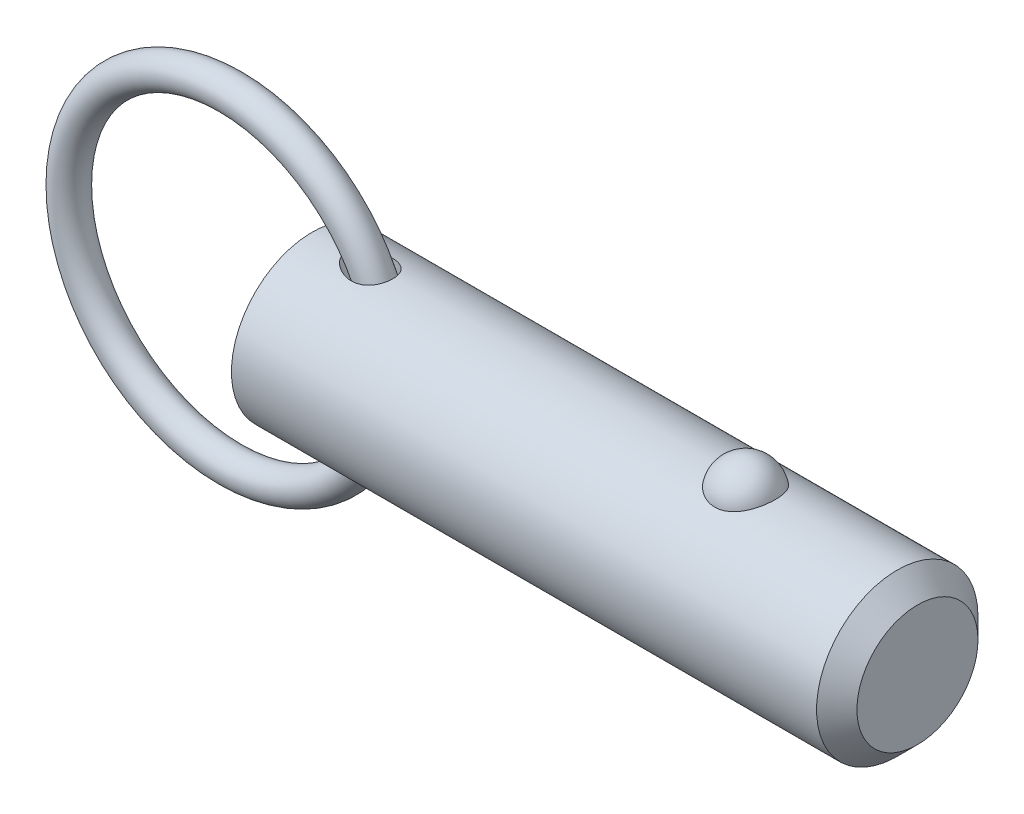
ISO-10303-21;
HEADER;
FILE_DESCRIPTION(('STEP AP214'),'2;1');
FILE_NAME('part.step','',(''),(''),'','','');
FILE_SCHEMA(('AUTOMOTIVE_DESIGN { 1 0 10303 214 1 1 1 1 }'));
ENDSEC;
DATA;
#1=APPLICATION_CONTEXT('core data for automotive mechanical design processes');
#2=APPLICATION_PROTOCOL_DEFINITION('international standard','automotive_design',2000,#1);
#3=PRODUCT_CONTEXT('',#1,'mechanical');
#4=PRODUCT('Part','Part','',(#3));
#5=PRODUCT_RELATED_PRODUCT_CATEGORY('part','',(#4));
#6=PRODUCT_DEFINITION_FORMATION('','',#4);
#7=PRODUCT_DEFINITION_CONTEXT('part definition',#1,'design');
#8=PRODUCT_DEFINITION('design','',#6,#7);
#9=PRODUCT_DEFINITION_SHAPE('','',#8);
#10=(LENGTH_UNIT() NAMED_UNIT(*) SI_UNIT(.MILLI.,.METRE.));
#11=(NAMED_UNIT(*) PLANE_ANGLE_UNIT() SI_UNIT($,.RADIAN.));
#12=(NAMED_UNIT(*) SI_UNIT($,.STERADIAN.) SOLID_ANGLE_UNIT());
#13=UNCERTAINTY_MEASURE_WITH_UNIT(LENGTH_MEASURE(1.E-05),#10,'distance_accuracy_value','');
#14=(GEOMETRIC_REPRESENTATION_CONTEXT(3) GLOBAL_UNCERTAINTY_ASSIGNED_CONTEXT((#13)) GLOBAL_UNIT_ASSIGNED_CONTEXT((#10,
#11,#12)) REPRESENTATION_CONTEXT('',''));
#15=CARTESIAN_POINT('',(0.,0.,0.));
#16=DIRECTION('',(0.,0.,1.));
#17=DIRECTION('',(1.,0.,0.));
#18=AXIS2_PLACEMENT_3D('',#15,#16,#17);
#19=CARTESIAN_POINT('',(-9.66825126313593,0.,0.));
#20=DIRECTION('',(0.,0.,1.));
#21=DIRECTION('',(1.,0.,0.));
#22=AXIS2_PLACEMENT_3D('',#19,#20,#21);
#23=TOROIDAL_SURFACE('',#22,19.05,1.905);
#24=CARTESIAN_POINT('',(11.2867487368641,0.,0.));
#25=VERTEX_POINT('',#24);
#26=VERTEX_LOOP('',#25);
#27=FACE_BOUND('',#26,.T.);
#28=ADVANCED_FACE('P0_F12',(#27),#23,.T.);
#29=CLOSED_SHELL('',(#28));
#30=MANIFOLD_SOLID_BREP('P0_B1',#29);
#31=CARTESIAN_POINT('',(0.,0.,0.));
#32=DIRECTION('',(1.,0.,0.));
#33=DIRECTION('',(0.,0.,-1.));
#34=AXIS2_PLACEMENT_3D('',#31,#32,#33);
#35=CYLINDRICAL_SURFACE('',#34,9.525);
#36=CARTESIAN_POINT('',(4.56693409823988,9.43141941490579,-1.33189820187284));
#37=CARTESIAN_POINT('',(4.70260475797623,9.41020313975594,-1.48215931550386));
#38=CARTESIAN_POINT('',(4.85555680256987,9.38755003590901,-1.61683982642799));
#39=CARTESIAN_POINT('',(5.10171959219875,9.35450554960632,-1.79512943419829));
#40=CARTESIAN_POINT('',(5.18674514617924,9.34362629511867,-1.85068909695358));
#41=CARTESIAN_POINT('',(5.36154389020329,9.32258514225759,-1.95392002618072));
#42=CARTESIAN_POINT('',(5.45131542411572,9.31242299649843,-2.00159402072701));
#43=CARTESIAN_POINT('',(5.70070211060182,9.28632120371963,-2.12033289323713));
#44=CARTESIAN_POINT('',(5.86420408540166,9.27146938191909,-2.18362944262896));
#45=CARTESIAN_POINT('',(6.19893345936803,9.24694163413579,-2.28525783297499));
#46=CARTESIAN_POINT('',(6.37015384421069,9.23726110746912,-2.32361187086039));
#47=CARTESIAN_POINT('',(6.73531776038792,9.22400982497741,-2.37575048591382));
#48=CARTESIAN_POINT('',(6.92975826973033,9.22118808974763,-2.38652934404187));
#49=CARTESIAN_POINT('',(7.21995443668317,9.22416297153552,-2.37494980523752));
#50=CARTESIAN_POINT('',(7.31643847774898,9.22635560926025,-2.366466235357));
#51=CARTESIAN_POINT('',(7.50796421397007,9.2331428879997,-2.33985028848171));
#52=CARTESIAN_POINT('',(7.60300650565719,9.23773650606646,-2.32172202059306));
#53=CARTESIAN_POINT('',(7.83273114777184,9.25183311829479,-2.26504721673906));
#54=CARTESIAN_POINT('',(7.96603028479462,9.26261470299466,-2.2209856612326));
#55=CARTESIAN_POINT('',(8.22310899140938,9.28816519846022,-2.11157306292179));
#56=CARTESIAN_POINT('',(8.34689477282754,9.30293147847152,-2.04623606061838));
#57=CARTESIAN_POINT('',(8.58136049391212,9.3349416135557,-1.89485344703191));
#58=CARTESIAN_POINT('',(8.69199721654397,9.35219324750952,-1.80874222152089));
#59=CARTESIAN_POINT('',(8.89592093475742,9.38707016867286,-1.61799188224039));
#60=CARTESIAN_POINT('',(8.98920771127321,9.40469546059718,-1.51335253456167));
#61=CARTESIAN_POINT('',(9.15057731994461,9.43713590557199,-1.29519427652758));
#62=CARTESIAN_POINT('',(9.21980158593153,9.45205440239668,-1.18253282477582));
#63=CARTESIAN_POINT('',(9.33826736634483,9.47856708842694,-0.946802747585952));
#64=CARTESIAN_POINT('',(9.38751161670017,9.49016173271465,-0.823735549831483));
#65=CARTESIAN_POINT('',(9.46423850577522,9.50859378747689,-0.572614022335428));
#66=CARTESIAN_POINT('',(9.49202393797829,9.5154972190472,-0.444656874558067));
#67=CARTESIAN_POINT('',(9.52636926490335,9.52406905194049,-0.185752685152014));
#68=CARTESIAN_POINT('',(9.53292923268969,9.52573747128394,-0.0548056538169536));
#69=CARTESIAN_POINT('',(9.52467276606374,9.52365852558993,0.206503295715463));
#70=CARTESIAN_POINT('',(9.50983454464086,9.51990564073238,0.336864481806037));
#71=CARTESIAN_POINT('',(9.45907362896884,9.50737852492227,0.59316631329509));
#72=CARTESIAN_POINT('',(9.42315106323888,9.49860432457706,0.71910698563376));
#73=CARTESIAN_POINT('',(9.33106648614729,9.47698928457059,0.96295935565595));
#74=CARTESIAN_POINT('',(9.27490839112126,9.46414923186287,1.08087260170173));
#75=CARTESIAN_POINT('',(9.14375803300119,9.43581000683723,1.30534632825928));
#76=CARTESIAN_POINT('',(9.06876720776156,9.42031103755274,1.41190767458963));
#77=CARTESIAN_POINT('',(8.90203187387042,9.38836719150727,1.61069439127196));
#78=CARTESIAN_POINT('',(8.81029913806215,9.37192298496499,1.70292975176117));
#79=CARTESIAN_POINT('',(8.61268775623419,9.33985045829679,1.87086859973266));
#80=CARTESIAN_POINT('',(8.50680947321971,9.3242221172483,1.94657251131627));
#81=CARTESIAN_POINT('',(8.28220546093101,9.29513431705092,2.08109032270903));
#82=CARTESIAN_POINT('',(8.16329919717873,9.28171415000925,2.1396103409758));
#83=CARTESIAN_POINT('',(7.91756052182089,9.25859072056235,2.23755716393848));
#84=CARTESIAN_POINT('',(7.79072606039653,9.24888842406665,2.27697900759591));
#85=CARTESIAN_POINT('',(7.52377913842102,9.23338749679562,2.33907806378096));
#86=CARTESIAN_POINT('',(7.38334767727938,9.22789571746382,2.36044900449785));
#87=CARTESIAN_POINT('',(7.10081394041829,9.22210229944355,2.3829751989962));
#88=CARTESIAN_POINT('',(6.95871103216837,9.22180269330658,2.38412253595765));
#89=CARTESIAN_POINT('',(6.65642691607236,9.22632724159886,2.36656230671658));
#90=CARTESIAN_POINT('',(6.49641694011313,9.23185415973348,2.3451317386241));
#91=CARTESIAN_POINT('',(6.18115433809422,9.24811737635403,2.28014143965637));
#92=CARTESIAN_POINT('',(6.02590710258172,9.25885936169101,2.23655754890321));
#93=CARTESIAN_POINT('',(5.6990472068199,9.28624254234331,2.12025087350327));
#94=CARTESIAN_POINT('',(5.52873601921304,9.30354853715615,2.04400672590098));
#95=CARTESIAN_POINT('',(5.20289495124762,9.34106989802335,1.86504730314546));
#96=CARTESIAN_POINT('',(5.04735968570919,9.36128419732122,1.76234172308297));
#97=CARTESIAN_POINT('',(4.79287124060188,9.39697639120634,1.55895334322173));
#98=CARTESIAN_POINT('',(4.68938704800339,9.41240250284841,1.46392900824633));
#99=CARTESIAN_POINT('',(4.49847141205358,9.44202586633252,1.25875918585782));
#100=CARTESIAN_POINT('',(4.41101129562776,9.45622528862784,1.1486413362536));
#101=CARTESIAN_POINT('',(4.27502257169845,9.47888210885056,0.940600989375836));
#102=CARTESIAN_POINT('',(4.22216329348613,9.48791121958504,0.845586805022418));
#103=CARTESIAN_POINT('',(4.13241478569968,9.50344321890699,0.648051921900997));
#104=CARTESIAN_POINT('',(4.09551182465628,9.50994827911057,0.545537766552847));
#105=CARTESIAN_POINT('',(4.04043124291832,9.51971586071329,0.334452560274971));
#106=CARTESIAN_POINT('',(4.02240728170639,9.52295176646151,0.225839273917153));
#107=CARTESIAN_POINT('',(4.00750873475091,9.52562364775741,0.00713006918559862));
#108=CARTESIAN_POINT('',(4.01062334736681,9.52506156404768,-0.10296506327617));
#109=CARTESIAN_POINT('',(4.03592967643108,9.52053221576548,-0.306944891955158));
#110=CARTESIAN_POINT('',(4.05571676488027,9.51699426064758,-0.401151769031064));
#111=CARTESIAN_POINT('',(4.10967975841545,9.5074546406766,-0.585176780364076));
#112=CARTESIAN_POINT('',(4.14385995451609,9.50145224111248,-0.674993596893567));
#113=CARTESIAN_POINT('',(4.23261356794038,9.48611703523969,-0.866116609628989));
#114=CARTESIAN_POINT('',(4.28990016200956,9.47635800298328,-0.96612166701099));
#115=CARTESIAN_POINT('',(4.41856577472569,9.45502867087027,-1.15640011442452));
#116=CARTESIAN_POINT('',(4.48996918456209,9.44345524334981,-1.24665623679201));
#117=CARTESIAN_POINT('',(4.56693409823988,9.43141941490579,-1.33189820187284));
#118=B_SPLINE_CURVE_WITH_KNOTS('',3,(#36,#37,#38,#39,#40,#41,#42,#43,#44,#45,#46,#47,#48,#49,
#50,#51,#52,#53,#54,#55,#56,#57,#58,#59,#60,#61,#62,#63,#64,#65,#66,#67,#68,#69,#70,#71,#72,#73,
#74,#75,#76,#77,#78,#79,#80,#81,#82,#83,#84,#85,#86,#87,#88,#89,#90,#91,#92,#93,#94,#95,#96,#97,
#98,#99,#100,#101,#102,#103,#104,#105,#106,#107,#108,#109,#110,#111,#112,#113,#114,#115,#116,
#117),.UNSPECIFIED.,.T.,.F.,(4,2,2,2,2,2,2,2,2,2,2,2,2,2,2,2,2,2,2,2,2,2,2,2,2,2,2,2,2,2,2,2,2,
2,2,2,2,2,2,2,4),(0.,0.609951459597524,0.916123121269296,1.22218863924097,1.74791337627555,
2.27316961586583,2.85362722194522,3.14383229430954,3.43391382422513,3.85437497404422,
4.27455920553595,4.69608835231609,5.11762282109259,5.5149005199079,5.91212379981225,
6.30363414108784,6.69514313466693,7.08705103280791,7.47895654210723,7.87078624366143,
8.26258603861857,8.65411137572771,9.04562666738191,9.44349251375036,9.84146165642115,
10.2662286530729,10.6911619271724,11.1739180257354,11.6572017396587,12.2170157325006,
12.776624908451,13.1992556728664,13.6211226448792,13.9471990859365,14.2729943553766,
14.6014211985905,14.9296802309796,15.2173810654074,15.505167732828,15.8505863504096,
16.1966070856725),.UNSPECIFIED.);
#119=CARTESIAN_POINT('',(4.56693409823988,9.43141941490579,-1.33189820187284));
#120=VERTEX_POINT('',#119);
#121=EDGE_CURVE('P1_E40',#120,#120,#118,.T.);
#122=ORIENTED_EDGE('',*,*,#121,.T.);
#123=EDGE_LOOP('',(#122));
#124=FACE_BOUND('',#123,.T.);
#125=CARTESIAN_POINT('',(69.04875,0.,0.));
#126=DIRECTION('',(1.,0.,0.));
#127=DIRECTION('',(0.,0.,-1.));
#128=AXIS2_PLACEMENT_3D('',#125,#126,#127);
#129=CIRCLE('',#128,9.525);
#130=CARTESIAN_POINT('',(69.04875,0.,-9.525));
#131=VERTEX_POINT('',#130);
#132=EDGE_CURVE('P1_E25',#131,#131,#129,.T.);
#133=ORIENTED_EDGE('',*,*,#132,.F.);
#134=EDGE_LOOP('',(#133));
#135=FACE_BOUND('',#134,.T.);
#136=CARTESIAN_POINT('',(0.,0.,0.));
#137=DIRECTION('',(1.,0.,0.));
#138=DIRECTION('',(0.,0.,-1.));
#139=AXIS2_PLACEMENT_3D('',#136,#137,#138);
#140=CIRCLE('',#139,9.525);
#141=CARTESIAN_POINT('',(0.,0.,-9.525));
#142=VERTEX_POINT('',#141);
#143=EDGE_CURVE('P1_E9',#142,#142,#140,.T.);
#144=ORIENTED_EDGE('',*,*,#143,.T.);
#145=EDGE_LOOP('',(#144));
#146=FACE_BOUND('',#145,.T.);
#147=CARTESIAN_POINT('',(51.1457573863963,8.80405803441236,3.63513233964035));
#148=CARTESIAN_POINT('',(51.0516766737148,8.80405953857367,3.63513053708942));
#149=CARTESIAN_POINT('',(50.9575618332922,8.80561325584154,3.6313746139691));
#150=CARTESIAN_POINT('',(50.7700126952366,8.81177748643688,3.61638665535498));
#151=CARTESIAN_POINT('',(50.6765788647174,8.81638992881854,3.60514990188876));
#152=CARTESIAN_POINT('',(50.3979452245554,8.8346711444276,3.56024627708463));
#153=CARTESIAN_POINT('',(50.2146916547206,8.85278327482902,3.51538626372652));
#154=CARTESIAN_POINT('',(49.859509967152,8.89871214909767,3.39742145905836));
#155=CARTESIAN_POINT('',(49.6875533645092,8.9265032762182,3.32439116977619));
#156=CARTESIAN_POINT('',(49.358707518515,8.98874819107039,3.1522024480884));
#157=CARTESIAN_POINT('',(49.2018114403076,9.02319893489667,3.05305594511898));
#158=CARTESIAN_POINT('',(48.9022147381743,9.09629186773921,2.82797815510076));
#159=CARTESIAN_POINT('',(48.7600600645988,9.13502685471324,2.7013513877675));
#160=CARTESIAN_POINT('',(48.4982999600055,9.2118657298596,2.4264193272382));
#161=CARTESIAN_POINT('',(48.3787015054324,9.2499694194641,2.27810735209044));
#162=CARTESIAN_POINT('',(48.159645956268,9.32341082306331,1.95652290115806));
#163=CARTESIAN_POINT('',(48.0613174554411,9.35855090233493,1.78243511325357));
#164=CARTESIAN_POINT('',(47.8938190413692,9.42045142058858,1.41937246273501));
#165=CARTESIAN_POINT('',(47.8246511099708,9.44721128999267,1.23039658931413));
#166=CARTESIAN_POINT('',(47.7161994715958,9.48990641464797,0.840370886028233));
#167=CARTESIAN_POINT('',(47.6772880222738,9.50570658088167,0.639202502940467));
#168=CARTESIAN_POINT('',(47.6315550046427,9.52433146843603,0.232664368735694));
#169=CARTESIAN_POINT('',(47.6247324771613,9.52715657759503,0.0272947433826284));
#170=CARTESIAN_POINT('',(47.643255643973,9.51956918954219,-0.380478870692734));
#171=CARTESIAN_POINT('',(47.6684052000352,9.50923740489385,-0.582893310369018));
#172=CARTESIAN_POINT('',(47.75002537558,9.47651897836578,-0.980293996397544));
#173=CARTESIAN_POINT('',(47.8064966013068,9.45413210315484,-1.17528009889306));
#174=CARTESIAN_POINT('',(47.9497192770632,9.39954044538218,-1.55263697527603));
#175=CARTESIAN_POINT('',(48.0365124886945,9.36732213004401,-1.73498993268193));
#176=CARTESIAN_POINT('',(48.2386103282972,9.29640700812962,-2.08177763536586));
#177=CARTESIAN_POINT('',(48.3539172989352,9.25770966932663,-2.24621090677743));
#178=CARTESIAN_POINT('',(48.611264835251,9.17775604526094,-2.5533833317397));
#179=CARTESIAN_POINT('',(48.7534344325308,9.136488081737,-2.69601150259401));
#180=CARTESIAN_POINT('',(49.06089985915,9.05620497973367,-2.95451229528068));
#181=CARTESIAN_POINT('',(49.226193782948,9.01718965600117,-3.07038711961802));
#182=CARTESIAN_POINT('',(49.572052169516,8.9468001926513,-3.26976836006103));
#183=CARTESIAN_POINT('',(49.7522278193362,8.91528408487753,-3.35389750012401));
#184=CARTESIAN_POINT('',(50.1256514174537,8.86272514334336,-3.49043503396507));
#185=CARTESIAN_POINT('',(50.3188944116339,8.8416783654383,-3.54285537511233));
#186=CARTESIAN_POINT('',(50.7025036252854,8.81348056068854,-3.61241306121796));
#187=CARTESIAN_POINT('',(50.8925251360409,8.80568348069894,-3.63119339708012));
#188=CARTESIAN_POINT('',(51.2731906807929,8.80289410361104,-3.63795342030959));
#189=CARTESIAN_POINT('',(51.4638345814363,8.80789922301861,-3.62593932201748));
#190=CARTESIAN_POINT('',(51.834007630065,8.8297491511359,-3.57238430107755));
#191=CARTESIAN_POINT('',(52.0136976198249,8.84621463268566,-3.53178890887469));
#192=CARTESIAN_POINT('',(52.3634226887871,8.88875330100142,-3.42331083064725));
#193=CARTESIAN_POINT('',(52.5334569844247,8.91482726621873,-3.35542593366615));
#194=CARTESIAN_POINT('',(52.8632377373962,8.97448239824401,-3.19248225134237));
#195=CARTESIAN_POINT('',(53.0226801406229,9.00821446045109,-3.09686474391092));
#196=CARTESIAN_POINT('',(53.3235136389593,9.07935398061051,-2.88162736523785));
#197=CARTESIAN_POINT('',(53.4649005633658,9.11676228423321,-2.76200196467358));
#198=CARTESIAN_POINT('',(53.7333193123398,9.19347419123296,-2.49516285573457));
#199=CARTESIAN_POINT('',(53.8592750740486,9.23277872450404,-2.34686614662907));
#200=CARTESIAN_POINT('',(54.0855227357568,9.30737610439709,-2.03093683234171));
#201=CARTESIAN_POINT('',(54.1858100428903,9.34266823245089,-1.86330077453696));
#202=CARTESIAN_POINT('',(54.3615149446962,9.40674710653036,-1.50744893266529));
#203=CARTESIAN_POINT('',(54.436041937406,9.4352917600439,-1.31874876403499));
#204=CARTESIAN_POINT('',(54.5541650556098,9.48144132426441,-0.930631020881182));
#205=CARTESIAN_POINT('',(54.5977608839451,9.49904612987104,-0.731213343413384));
#206=CARTESIAN_POINT('',(54.6531580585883,9.5215314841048,-0.327147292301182));
#207=CARTESIAN_POINT('',(54.6649354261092,9.52640243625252,-0.12249509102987));
#208=CARTESIAN_POINT('',(54.6563825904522,9.52289571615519,0.286018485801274));
#209=CARTESIAN_POINT('',(54.6360530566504,9.51451832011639,0.489879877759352));
#210=CARTESIAN_POINT('',(54.5638840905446,9.48544083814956,0.889994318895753));
#211=CARTESIAN_POINT('',(54.5121993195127,9.46480124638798,1.08627971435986));
#212=CARTESIAN_POINT('',(54.3784917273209,9.4133389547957,1.46682086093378));
#213=CARTESIAN_POINT('',(54.2964668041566,9.38251554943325,1.65107577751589));
#214=CARTESIAN_POINT('',(54.1031929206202,9.31365636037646,2.00346348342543));
#215=CARTESIAN_POINT('',(53.9917838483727,9.27558138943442,2.17150083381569));
#216=CARTESIAN_POINT('',(53.7422947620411,9.19638714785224,2.4856311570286));
#217=CARTESIAN_POINT('',(53.6042163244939,9.15526805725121,2.63172542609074));
#218=CARTESIAN_POINT('',(53.3048438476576,9.07465393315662,2.89750997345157));
#219=CARTESIAN_POINT('',(53.1436109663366,9.03515496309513,3.01726776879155));
#220=CARTESIAN_POINT('',(52.8016136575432,8.96227564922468,3.22732920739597));
#221=CARTESIAN_POINT('',(52.620841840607,8.92889763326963,3.31762165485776));
#222=CARTESIAN_POINT('',(52.2514451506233,8.8734538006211,3.46314419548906));
#223=CARTESIAN_POINT('',(52.0633237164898,8.85102983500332,3.51950082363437));
#224=CARTESIAN_POINT('',(51.7757869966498,8.8266696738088,3.57993683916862));
#225=CARTESIAN_POINT('',(51.6791339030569,8.82009725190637,3.59606217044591));
#226=CARTESIAN_POINT('',(51.4846770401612,8.81020897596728,3.62022512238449));
#227=CARTESIAN_POINT('',(51.3868741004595,8.80689090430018,3.62826825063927));
#228=CARTESIAN_POINT('',(51.2412243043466,8.80445615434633,3.63416760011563));
#229=CARTESIAN_POINT('',(51.1934952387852,8.80405727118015,3.63513325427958));
#230=CARTESIAN_POINT('',(51.1457573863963,8.80405803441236,3.63513233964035));
#231=B_SPLINE_CURVE_WITH_KNOTS('',3,(#147,#148,#149,#150,#151,#152,#153,#154,#155,#156,#157,
#158,#159,#160,#161,#162,#163,#164,#165,#166,#167,#168,#169,#170,#171,#172,#173,#174,#175,#176,
#177,#178,#179,#180,#181,#182,#183,#184,#185,#186,#187,#188,#189,#190,#191,#192,#193,#194,#195,
#196,#197,#198,#199,#200,#201,#202,#203,#204,#205,#206,#207,#208,#209,#210,#211,#212,#213,#214,
#215,#216,#217,#218,#219,#220,#221,#222,#223,#224,#225,#226,#227,#228,#229,#230),.UNSPECIFIED.,
.T.,.F.,(4,2,2,2,2,2,2,2,2,2,2,2,2,2,2,2,2,2,2,2,2,2,2,2,2,2,2,2,2,2,2,2,2,2,2,2,2,2,2,2,2,4),
(0.,0.282202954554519,0.564584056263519,1.13017050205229,1.69427128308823,2.25811483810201,
2.83836627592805,3.41879688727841,4.02497117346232,4.63118665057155,5.24474754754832,
5.85829010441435,6.46808687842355,7.0778954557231,7.68854723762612,8.29924920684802,
8.91296283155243,9.52662591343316,10.1275338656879,10.7282152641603,11.2986646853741,
11.868998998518,12.4213015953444,12.973648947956,13.5380053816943,14.1024919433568,
14.695298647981,15.2882113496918,15.8999469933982,16.5116885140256,17.1238909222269,
17.7360805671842,18.3452748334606,18.9545113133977,19.567138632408,20.1797297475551,
20.7907316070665,21.4019653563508,21.9915938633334,22.2859053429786,22.580016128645,
22.723209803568),.UNSPECIFIED.);
#232=CARTESIAN_POINT('',(51.1457573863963,8.80405803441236,3.63513233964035));
#233=VERTEX_POINT('',#232);
#234=EDGE_CURVE('P1_E34',#233,#233,#231,.T.);
#235=ORIENTED_EDGE('',*,*,#234,.T.);
#236=EDGE_LOOP('',(#235));
#237=FACE_BOUND('',#236,.T.);
#238=CARTESIAN_POINT('',(4.56693409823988,-9.43141941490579,-1.33189820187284));
#239=CARTESIAN_POINT('',(4.48932984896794,-9.4435553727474,-1.24594548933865));
#240=CARTESIAN_POINT('',(4.41737309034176,-9.45522193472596,-1.1548795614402));
#241=CARTESIAN_POINT('',(4.2878104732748,-9.47670896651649,-0.962782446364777));
#242=CARTESIAN_POINT('',(4.23019403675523,-9.48653079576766,-0.861758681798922));
#243=CARTESIAN_POINT('',(4.13254559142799,-9.5034118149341,-0.649723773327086));
#244=CARTESIAN_POINT('',(4.09271158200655,-9.51043980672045,-0.538615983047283));
#245=CARTESIAN_POINT('',(4.04973167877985,-9.51806966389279,-0.367764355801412));
#246=CARTESIAN_POINT('',(4.03820037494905,-9.52012756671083,-0.310118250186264));
#247=CARTESIAN_POINT('',(4.02100287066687,-9.52320274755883,-0.193935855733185));
#248=CARTESIAN_POINT('',(4.01533565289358,-9.52422020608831,-0.13539972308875));
#249=CARTESIAN_POINT('',(4.00817074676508,-9.52550497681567,0.0247266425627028));
#250=CARTESIAN_POINT('',(4.01270492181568,-9.52468821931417,0.126661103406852));
#251=CARTESIAN_POINT('',(4.0395497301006,-9.51988506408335,0.328012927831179));
#252=CARTESIAN_POINT('',(4.0618645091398,-9.51589792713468,0.427429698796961));
#253=CARTESIAN_POINT('',(4.12088980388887,-9.5054852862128,0.61636200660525));
#254=CARTESIAN_POINT('',(4.15684838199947,-9.49918763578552,0.706123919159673));
#255=CARTESIAN_POINT('',(4.24094647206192,-9.48470618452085,0.879522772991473));
#256=CARTESIAN_POINT('',(4.28909090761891,-9.47652162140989,0.96315722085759));
#257=CARTESIAN_POINT('',(4.42295891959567,-9.45426317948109,1.16513741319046));
#258=CARTESIAN_POINT('',(4.51523752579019,-9.43933320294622,1.27905352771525));
#259=CARTESIAN_POINT('',(4.71682295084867,-9.40825940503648,1.49055892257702));
#260=CARTESIAN_POINT('',(4.8261728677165,-9.39211256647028,1.58810554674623));
#261=CARTESIAN_POINT('',(5.09064226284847,-9.35555264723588,1.79246125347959));
#262=CARTESIAN_POINT('',(5.24990411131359,-9.33524115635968,1.89393122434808));
#263=CARTESIAN_POINT('',(5.58309255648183,-9.29785396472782,2.06968659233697));
#264=CARTESIAN_POINT('',(5.75702897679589,-9.28078045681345,2.14395359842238));
#265=CARTESIAN_POINT('',(6.11646882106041,-9.25213303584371,2.26440412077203));
#266=CARTESIAN_POINT('',(6.3020558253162,-9.2406056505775,2.31035092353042));
#267=CARTESIAN_POINT('',(6.67856093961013,-9.22541807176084,2.37029728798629));
#268=CARTESIAN_POINT('',(6.86947045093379,-9.2217458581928,2.3843456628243));
#269=CARTESIAN_POINT('',(7.21217144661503,-9.22344239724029,2.37775005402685));
#270=CARTESIAN_POINT('',(7.36409439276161,-9.22713860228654,2.36352577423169));
#271=CARTESIAN_POINT('',(7.66346227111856,-9.24048072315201,2.31082299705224));
#272=CARTESIAN_POINT('',(7.81090958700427,-9.25012341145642,2.27235765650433));
#273=CARTESIAN_POINT('',(8.09730316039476,-9.2746609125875,2.17003648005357));
#274=CARTESIAN_POINT('',(8.23619652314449,-9.28958517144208,2.10603803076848));
#275=CARTESIAN_POINT('',(8.49918675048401,-9.32290326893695,1.9532444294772));
#276=CARTESIAN_POINT('',(8.62328895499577,-9.34129584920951,1.86445826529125));
#277=CARTESIAN_POINT('',(8.84006515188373,-9.37706953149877,1.67466761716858));
#278=CARTESIAN_POINT('',(8.93465172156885,-9.39436331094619,1.57582357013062));
#279=CARTESIAN_POINT('',(9.1049023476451,-9.42761680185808,1.362809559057));
#280=CARTESIAN_POINT('',(9.18057146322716,-9.44357686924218,1.24864370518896));
#281=CARTESIAN_POINT('',(9.30789178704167,-9.47159985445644,1.01379272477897));
#282=CARTESIAN_POINT('',(9.3604554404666,-9.48380365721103,0.893617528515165));
#283=CARTESIAN_POINT('',(9.44498362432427,-9.50388751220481,0.645890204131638));
#284=CARTESIAN_POINT('',(9.47694947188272,-9.51176784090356,0.518338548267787));
#285=CARTESIAN_POINT('',(9.51944262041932,-9.52232073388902,0.260103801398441));
#286=CARTESIAN_POINT('',(9.53006646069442,-9.52501674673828,0.129437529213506));
#287=CARTESIAN_POINT('',(9.52993291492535,-9.52498309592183,-0.131885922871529));
#288=CARTESIAN_POINT('',(9.51917525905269,-9.52225336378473,-0.262543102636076));
#289=CARTESIAN_POINT('',(9.47648788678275,-9.51165418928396,-0.520312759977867));
#290=CARTESIAN_POINT('',(9.44453086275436,-9.50377811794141,-0.647420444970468));
#291=CARTESIAN_POINT('',(9.36015568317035,-9.48373425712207,-0.894290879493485));
#292=CARTESIAN_POINT('',(9.30773827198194,-9.47156662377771,-1.01405389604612));
#293=CARTESIAN_POINT('',(9.18380895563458,-9.44428888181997,-1.24269386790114));
#294=CARTESIAN_POINT('',(9.11232064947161,-9.42918241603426,-1.3515840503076));
#295=CARTESIAN_POINT('',(8.95212687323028,-9.39767706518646,-1.55562459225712));
#296=CARTESIAN_POINT('',(8.86342281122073,-9.3812782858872,-1.65077607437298));
#297=CARTESIAN_POINT('',(8.67104443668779,-9.34891827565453,-1.82517515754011));
#298=CARTESIAN_POINT('',(8.56732858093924,-9.33295841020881,-1.90437711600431));
#299=CARTESIAN_POINT('',(8.34818438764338,-9.30317889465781,-2.0449122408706));
#300=CARTESIAN_POINT('',(8.23275529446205,-9.2893593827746,-2.10624425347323));
#301=CARTESIAN_POINT('',(7.98961240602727,-9.26475003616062,-2.2120340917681));
#302=CARTESIAN_POINT('',(7.86162088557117,-9.25407358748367,-2.25587700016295));
#303=CARTESIAN_POINT('',(7.60027499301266,-9.23720810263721,-2.32397032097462));
#304=CARTESIAN_POINT('',(7.46691858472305,-9.23102078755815,-2.34821321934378));
#305=CARTESIAN_POINT('',(7.18516230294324,-9.22302718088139,-2.37943079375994));
#306=CARTESIAN_POINT('',(7.0365445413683,-9.22169704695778,-2.38452997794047));
#307=CARTESIAN_POINT('',(6.74015049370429,-9.22442327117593,-2.37395141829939));
#308=CARTESIAN_POINT('',(6.59237455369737,-9.22848170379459,-2.35826567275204));
#309=CARTESIAN_POINT('',(6.27762777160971,-9.2422287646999,-2.30385559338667));
#310=CARTESIAN_POINT('',(6.11124715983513,-9.25269504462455,-2.26192683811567));
#311=CARTESIAN_POINT('',(5.78635920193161,-9.27830776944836,-2.15445569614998));
#312=CARTESIAN_POINT('',(5.62786567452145,-9.29346211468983,-2.08887341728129));
#313=CARTESIAN_POINT('',(5.3901306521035,-9.31931237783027,-1.96924953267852));
#314=CARTESIAN_POINT('',(5.30683088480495,-9.32901725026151,-1.92292485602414));
#315=CARTESIAN_POINT('',(5.14455801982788,-9.34899035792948,-1.82334419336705));
#316=CARTESIAN_POINT('',(5.06558607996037,-9.35925874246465,-1.77008636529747));
#317=CARTESIAN_POINT('',(4.83670950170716,-9.39034445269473,-1.60010986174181));
#318=CARTESIAN_POINT('',(4.69422471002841,-9.41151337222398,-1.47288240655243));
#319=CARTESIAN_POINT('',(4.56693409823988,-9.43141941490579,-1.33189820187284));
#320=B_SPLINE_CURVE_WITH_KNOTS('',3,(#238,#239,#240,#241,#242,#243,#244,#245,#246,#247,#248,
#249,#250,#251,#252,#253,#254,#255,#256,#257,#258,#259,#260,#261,#262,#263,#264,#265,#266,#267,
#268,#269,#270,#271,#272,#273,#274,#275,#276,#277,#278,#279,#280,#281,#282,#283,#284,#285,#286,
#287,#288,#289,#290,#291,#292,#293,#294,#295,#296,#297,#298,#299,#300,#301,#302,#303,#304,#305,
#306,#307,#308,#309,#310,#311,#312,#313,#314,#315,#316,#317,#318,#319),.UNSPECIFIED.,.T.,.F.,(4,
2,2,2,2,2,2,2,2,2,2,2,2,2,2,2,2,2,2,2,2,2,2,2,2,2,2,2,2,2,2,2,2,2,2,2,2,2,2,2,4),(0.,
0.348900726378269,0.697543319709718,1.0499765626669,1.22617690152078,1.40234666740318,
1.70666745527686,2.01105922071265,2.30066493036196,2.59038784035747,3.03001384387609,
3.4707682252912,4.03766594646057,4.60494622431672,5.17690598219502,5.74798989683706,
6.2040084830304,6.65977977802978,7.11813321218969,7.57632066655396,7.98791759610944,
8.39940433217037,8.79273459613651,9.18603970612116,9.577561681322,9.96908859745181,
10.3611208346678,10.7531388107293,11.1446739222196,11.536177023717,11.9287850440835,
12.3214184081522,12.7268448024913,13.1324265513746,13.5768390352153,14.0214226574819,
14.5351685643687,15.0497849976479,15.3368801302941,15.6240516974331,16.1963372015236),.UNSPECIFIED.);
#321=CARTESIAN_POINT('',(4.56693409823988,-9.43141941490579,-1.33189820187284));
#322=VERTEX_POINT('',#321);
#323=EDGE_CURVE('P1_E17',#322,#322,#320,.T.);
#324=ORIENTED_EDGE('',*,*,#323,.T.);
#325=EDGE_LOOP('',(#324));
#326=FACE_BOUND('',#325,.T.);
#327=ADVANCED_FACE('P1_F13',(#124,#135,#146,#237,#326),#35,.T.);
#328=CARTESIAN_POINT('',(0.,0.,0.));
#329=DIRECTION('',(-1.,0.,0.));
#330=DIRECTION('',(0.,0.,1.));
#331=AXIS2_PLACEMENT_3D('',#328,#329,#330);
#332=PLANE('',#331);
#333=ORIENTED_EDGE('',*,*,#143,.F.);
#334=EDGE_LOOP('',(#333));
#335=FACE_BOUND('',#334,.T.);
#336=ADVANCED_FACE('P1_F15',(#335),#332,.T.);
#337=CARTESIAN_POINT('',(71.43,0.,0.));
#338=DIRECTION('',(-1.,0.,0.));
#339=DIRECTION('',(0.,0.,1.));
#340=AXIS2_PLACEMENT_3D('',#337,#338,#339);
#341=CONICAL_SURFACE('',#340,7.14375000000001,0.785398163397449);
#342=ORIENTED_EDGE('',*,*,#132,.T.);
#343=EDGE_LOOP('',(#342));
#344=FACE_BOUND('',#343,.T.);
#345=CARTESIAN_POINT('',(71.43,0.,0.));
#346=DIRECTION('',(1.,0.,0.));
#347=DIRECTION('',(0.,0.,-1.));
#348=AXIS2_PLACEMENT_3D('',#345,#346,#347);
#349=CIRCLE('',#348,7.14375000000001);
#350=CARTESIAN_POINT('',(71.43,0.,-7.14375000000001));
#351=VERTEX_POINT('',#350);
#352=EDGE_CURVE('P1_E30',#351,#351,#349,.T.);
#353=ORIENTED_EDGE('',*,*,#352,.F.);
#354=EDGE_LOOP('',(#353));
#355=FACE_BOUND('',#354,.T.);
#356=ADVANCED_FACE('P1_F55',(#344,#355),#341,.T.);
#357=CARTESIAN_POINT('',(71.43,7.14375000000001,0.));
#358=DIRECTION('',(1.,0.,0.));
#359=DIRECTION('',(0.,0.,-1.));
#360=AXIS2_PLACEMENT_3D('',#357,#358,#359);
#361=PLANE('',#360);
#362=ORIENTED_EDGE('',*,*,#352,.T.);
#363=EDGE_LOOP('',(#362));
#364=FACE_BOUND('',#363,.T.);
#365=ADVANCED_FACE('P1_F51',(#364),#361,.T.);
#366=CARTESIAN_POINT('',(51.1457573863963,8.57249999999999,0.));
#367=DIRECTION('',(-1.,0.,0.));
#368=DIRECTION('',(0.,1.,0.));
#369=AXIS2_PLACEMENT_3D('',#366,#367,#368);
#370=SPHERICAL_SURFACE('',#369,3.64250000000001);
#371=ORIENTED_EDGE('',*,*,#234,.F.);
#372=EDGE_LOOP('',(#371));
#373=FACE_BOUND('',#372,.T.);
#374=ADVANCED_FACE('P1_F46',(#373),#370,.T.);
#375=CARTESIAN_POINT('',(-9.66825126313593,0.,0.));
#376=DIRECTION('',(0.,0.,1.));
#377=DIRECTION('',(1.,0.,0.));
#378=AXIS2_PLACEMENT_3D('',#375,#376,#377);
#379=TOROIDAL_SURFACE('',#378,19.05,2.38125);
#380=ORIENTED_EDGE('',*,*,#323,.F.);
#381=EDGE_LOOP('',(#380));
#382=FACE_BOUND('',#381,.T.);
#383=ORIENTED_EDGE('',*,*,#121,.F.);
#384=EDGE_LOOP('',(#383));
#385=FACE_BOUND('',#384,.T.);
#386=ADVANCED_FACE('P1_F50',(#382,#385),#379,.F.);
#387=CLOSED_SHELL('',(#327,#336,#356,#365,#374,#386));
#388=MANIFOLD_SOLID_BREP('P1_B1',#387);
#389=ADVANCED_BREP_SHAPE_REPRESENTATION('',(#18,#30,#388),#14);
#390=SHAPE_DEFINITION_REPRESENTATION(#9,#389);
ENDSEC;
END-ISO-10303-21;
